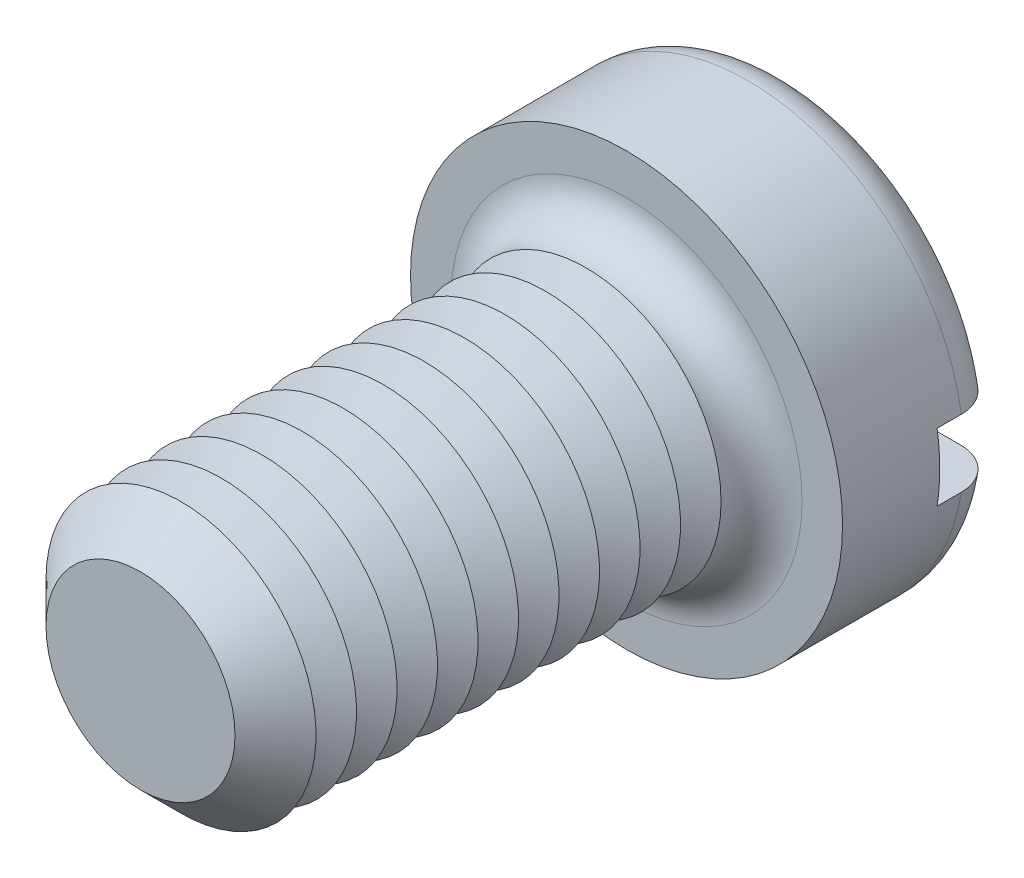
ISO-10303-21;
HEADER;
FILE_DESCRIPTION(('STEP AP214'),'2;1');
FILE_NAME('part.step','',(''),(''),'','','');
FILE_SCHEMA(('AUTOMOTIVE_DESIGN { 1 0 10303 214 1 1 1 1 }'));
ENDSEC;
DATA;
#1=APPLICATION_CONTEXT('core data for automotive mechanical design processes');
#2=APPLICATION_PROTOCOL_DEFINITION('international standard','automotive_design',2000,#1);
#3=PRODUCT_CONTEXT('',#1,'mechanical');
#4=PRODUCT('Part','Part','',(#3));
#5=PRODUCT_RELATED_PRODUCT_CATEGORY('part','',(#4));
#6=PRODUCT_DEFINITION_FORMATION('','',#4);
#7=PRODUCT_DEFINITION_CONTEXT('part definition',#1,'design');
#8=PRODUCT_DEFINITION('design','',#6,#7);
#9=PRODUCT_DEFINITION_SHAPE('','',#8);
#10=(LENGTH_UNIT() NAMED_UNIT(*) SI_UNIT(.MILLI.,.METRE.));
#11=(NAMED_UNIT(*) PLANE_ANGLE_UNIT() SI_UNIT($,.RADIAN.));
#12=(NAMED_UNIT(*) SI_UNIT($,.STERADIAN.) SOLID_ANGLE_UNIT());
#13=UNCERTAINTY_MEASURE_WITH_UNIT(LENGTH_MEASURE(1.E-05),#10,'distance_accuracy_value','');
#14=(GEOMETRIC_REPRESENTATION_CONTEXT(3) GLOBAL_UNCERTAINTY_ASSIGNED_CONTEXT((#13)) GLOBAL_UNIT_ASSIGNED_CONTEXT((#10,
#11,#12)) REPRESENTATION_CONTEXT('',''));
#15=CARTESIAN_POINT('',(0.,0.,0.));
#16=DIRECTION('',(0.,0.,1.));
#17=DIRECTION('',(1.,0.,0.));
#18=AXIS2_PLACEMENT_3D('',#15,#16,#17);
#19=CARTESIAN_POINT('',(0.,0.,-6.));
#20=DIRECTION('',(0.,0.,1.));
#21=DIRECTION('',(1.,0.,0.));
#22=AXIS2_PLACEMENT_3D('',#19,#20,#21);
#23=PLANE('',#22);
#24=CARTESIAN_POINT('',(0.,0.,-6.));
#25=DIRECTION('',(0.,0.,1.));
#26=DIRECTION('',(1.,0.,0.));
#27=AXIS2_PLACEMENT_3D('',#24,#25,#26);
#28=CIRCLE('',#27,6.5);
#29=CARTESIAN_POINT('',(-6.37867541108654,1.25,-6.));
#30=VERTEX_POINT('',#29);
#31=CARTESIAN_POINT('',(6.37867541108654,1.25,-6.));
#32=VERTEX_POINT('',#31);
#33=EDGE_CURVE('E116',#30,#32,#28,.F.);
#34=ORIENTED_EDGE('',*,*,#33,.T.);
#35=DIRECTION('',(1.,0.,0.));
#36=VECTOR('',#35,1.);
#37=CARTESIAN_POINT('',(-8.,1.25,-6.));
#38=LINE('',#37,#36);
#39=EDGE_CURVE('E111',#30,#32,#38,.T.);
#40=ORIENTED_EDGE('',*,*,#39,.F.);
#41=EDGE_LOOP('',(#34,#40));
#42=FACE_BOUND('',#41,.T.);
#43=ADVANCED_FACE('F39',(#42),#23,.F.);
#44=CARTESIAN_POINT('',(0.,0.,-4.5));
#45=DIRECTION('',(0.,0.,1.));
#46=DIRECTION('',(1.,0.,0.));
#47=AXIS2_PLACEMENT_3D('',#44,#45,#46);
#48=TOROIDAL_SURFACE('',#47,6.5,1.5);
#49=CARTESIAN_POINT('',(-7.63778128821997,1.25,-5.34492908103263));
#50=CARTESIAN_POINT('',(-7.58949199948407,1.25,-5.41482553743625));
#51=CARTESIAN_POINT('',(-7.53520056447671,1.25,-5.48065698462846));
#52=CARTESIAN_POINT('',(-7.41624971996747,1.25,-5.60228223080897));
#53=CARTESIAN_POINT('',(-7.35157642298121,1.25,-5.65806236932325));
#54=CARTESIAN_POINT('',(-7.21387612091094,1.25,-5.75795436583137));
#55=CARTESIAN_POINT('',(-7.14085828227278,1.25,-5.80207885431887));
#56=CARTESIAN_POINT('',(-6.98853766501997,1.25,-5.87758013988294));
#57=CARTESIAN_POINT('',(-6.90923642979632,1.25,-5.90896005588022));
#58=CARTESIAN_POINT('',(-6.74565677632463,1.25,-5.95849861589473));
#59=CARTESIAN_POINT('',(-6.66133328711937,1.25,-5.97650838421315));
#60=CARTESIAN_POINT('',(-6.49086565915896,1.25,-5.99833509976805));
#61=CARTESIAN_POINT('',(-6.40472129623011,1.25,-6.00215028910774));
#62=CARTESIAN_POINT('',(-6.23174891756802,1.25,-5.99550457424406));
#63=CARTESIAN_POINT('',(-6.14492874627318,1.25,-5.98483870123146));
#64=CARTESIAN_POINT('',(-5.97427268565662,1.25,-5.94920077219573));
#65=CARTESIAN_POINT('',(-5.89043699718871,1.25,-5.92422775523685));
#66=CARTESIAN_POINT('',(-5.72747580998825,1.25,-5.86041051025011));
#67=CARTESIAN_POINT('',(-5.64839123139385,1.25,-5.8214616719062));
#68=CARTESIAN_POINT('',(-5.49793182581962,1.25,-5.73076137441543));
#69=CARTESIAN_POINT('',(-5.42655700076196,1.25,-5.6790099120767));
#70=CARTESIAN_POINT('',(-5.29410028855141,1.25,-5.56444713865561));
#71=CARTESIAN_POINT('',(-5.23295591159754,1.25,-5.50170815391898));
#72=CARTESIAN_POINT('',(-5.12236155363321,1.25,-5.36664720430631));
#73=CARTESIAN_POINT('',(-5.07291010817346,1.25,-5.29432644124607));
#74=CARTESIAN_POINT('',(-4.98836421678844,1.25,-5.14389152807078));
#75=CARTESIAN_POINT('',(-4.95296843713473,1.25,-5.0659468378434));
#76=CARTESIAN_POINT('',(-4.89620356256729,1.25,-4.90510804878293));
#77=CARTESIAN_POINT('',(-4.87483169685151,1.25,-4.82221493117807));
#78=CARTESIAN_POINT('',(-4.8472995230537,1.25,-4.65636387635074));
#79=CARTESIAN_POINT('',(-4.84072446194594,1.25,-4.57347463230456));
#80=CARTESIAN_POINT('',(-4.84179430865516,1.25,-4.40779255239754));
#81=CARTESIAN_POINT('',(-4.84943782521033,1.25,-4.32499970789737));
#82=CARTESIAN_POINT('',(-4.87846819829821,1.25,-4.16301415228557));
#83=CARTESIAN_POINT('',(-4.89966978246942,1.25,-4.08378809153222));
#84=CARTESIAN_POINT('',(-4.95491528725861,1.25,-3.92995334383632));
#85=CARTESIAN_POINT('',(-4.98895983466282,1.25,-3.85534488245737));
#86=CARTESIAN_POINT('',(-5.06928242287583,1.25,-3.71183790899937));
#87=CARTESIAN_POINT('',(-5.11570495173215,1.25,-3.64302036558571));
#88=CARTESIAN_POINT('',(-5.21915370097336,1.25,-3.51388372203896));
#89=CARTESIAN_POINT('',(-5.27618132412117,1.25,-3.45356574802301));
#90=CARTESIAN_POINT('',(-5.40090076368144,1.25,-3.34137671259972));
#91=CARTESIAN_POINT('',(-5.46884305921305,1.25,-3.28978408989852));
#92=CARTESIAN_POINT('',(-5.61225757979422,1.25,-3.19841811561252));
#93=CARTESIAN_POINT('',(-5.68773079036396,1.25,-3.15864631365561));
#94=CARTESIAN_POINT('',(-5.84602026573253,1.25,-3.09111626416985));
#95=CARTESIAN_POINT('',(-5.92896901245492,1.25,-3.06366820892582));
#96=CARTESIAN_POINT('',(-6.09827849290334,1.25,-3.02294686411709));
#97=CARTESIAN_POINT('',(-6.18463944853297,1.25,-3.00967449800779));
#98=CARTESIAN_POINT('',(-6.35914138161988,1.25,-2.99765063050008));
#99=CARTESIAN_POINT('',(-6.4472913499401,1.25,-2.99902877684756));
#100=CARTESIAN_POINT('',(-6.62209547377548,1.25,-3.01665363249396));
#101=CARTESIAN_POINT('',(-6.70874965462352,1.25,-3.03290008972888));
#102=CARTESIAN_POINT('',(-6.87754008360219,1.25,-3.07975247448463));
#103=CARTESIAN_POINT('',(-6.95969991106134,1.25,-3.11027336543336));
#104=CARTESIAN_POINT('',(-7.11762200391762,1.25,-3.18486653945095));
#105=CARTESIAN_POINT('',(-7.19338469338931,1.25,-3.22893792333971));
#106=CARTESIAN_POINT('',(-7.33522754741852,1.25,-3.32873457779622));
#107=CARTESIAN_POINT('',(-7.40142768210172,1.25,-3.38428930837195));
#108=CARTESIAN_POINT('',(-7.52338344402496,1.25,-3.50587739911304));
#109=CARTESIAN_POINT('',(-7.5791399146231,1.25,-3.57190991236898));
#110=CARTESIAN_POINT('',(-7.67774856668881,1.25,-3.71151097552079));
#111=CARTESIAN_POINT('',(-7.72078137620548,1.25,-3.7849519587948));
#112=CARTESIAN_POINT('',(-7.79373860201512,1.25,-3.93807617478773));
#113=CARTESIAN_POINT('',(-7.82366445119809,1.25,-4.01775872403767));
#114=CARTESIAN_POINT('',(-7.86922494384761,1.25,-4.1801114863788));
#115=CARTESIAN_POINT('',(-7.88502105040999,1.25,-4.26273642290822));
#116=CARTESIAN_POINT('',(-7.90243332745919,1.25,-4.42948977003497));
#117=CARTESIAN_POINT('',(-7.90404643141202,1.25,-4.51361850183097));
#118=CARTESIAN_POINT('',(-7.89306914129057,1.25,-4.68049925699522));
#119=CARTESIAN_POINT('',(-7.88055163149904,1.25,-4.76325613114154));
#120=CARTESIAN_POINT('',(-7.84181179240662,1.25,-4.92542124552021));
#121=CARTESIAN_POINT('',(-7.81560657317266,1.25,-5.00483353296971));
#122=CARTESIAN_POINT('',(-7.76329893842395,1.25,-5.12766777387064));
#123=CARTESIAN_POINT('',(-7.74127773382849,1.25,-5.17287245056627));
#124=CARTESIAN_POINT('',(-7.69279783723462,1.25,-5.26083500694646));
#125=CARTESIAN_POINT('',(-7.66633917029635,1.25,-5.30359290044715));
#126=CARTESIAN_POINT('',(-7.63778128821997,1.25,-5.34492908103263));
#127=B_SPLINE_CURVE_WITH_KNOTS('',3,(#49,#50,#51,#52,#53,#54,#55,#56,#57,#58,#59,#60,#61,#62,
#63,#64,#65,#66,#67,#68,#69,#70,#71,#72,#73,#74,#75,#76,#77,#78,#79,#80,#81,#82,#83,#84,#85,#86,
#87,#88,#89,#90,#91,#92,#93,#94,#95,#96,#97,#98,#99,#100,#101,#102,#103,#104,#105,#106,#107,
#108,#109,#110,#111,#112,#113,#114,#115,#116,#117,#118,#119,#120,#121,#122,#123,#124,#125,#126),
.UNSPECIFIED.,.T.,.F.,(4,2,2,2,2,2,2,2,2,2,2,2,2,2,2,2,2,2,2,2,2,2,2,2,2,2,2,2,2,2,2,2,2,2,2,2,
2,2,4),(0.,0.254678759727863,0.509701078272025,0.764445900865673,1.01912834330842,
1.27660578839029,1.53411511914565,1.7953075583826,2.05651754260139,2.31972495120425,
2.58293242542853,2.84446831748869,3.10597143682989,3.36151874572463,3.61701554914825,
3.86525656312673,4.11347328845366,4.35836855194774,4.60327576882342,4.8511774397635,
5.0991119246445,5.35387584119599,5.60867314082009,5.86956650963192,6.13047687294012,
6.39369803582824,6.65691473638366,6.91858297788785,7.18023385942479,7.43824706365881,
7.69623942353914,7.95037087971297,8.20447454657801,8.45563599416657,8.70685174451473,
8.95677764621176,9.20639187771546,9.35700761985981,9.50762251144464),.UNSPECIFIED.);
#128=CARTESIAN_POINT('',(-7.90174031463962,1.25,-4.50000000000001));
#129=VERTEX_POINT('',#128);
#130=EDGE_CURVE('E259',#129,#30,#127,.T.);
#131=ORIENTED_EDGE('',*,*,#130,.F.);
#132=CARTESIAN_POINT('',(0.,0.,-4.5));
#133=DIRECTION('',(0.,0.,1.));
#134=DIRECTION('',(1.,0.,0.));
#135=AXIS2_PLACEMENT_3D('',#132,#133,#134);
#136=CIRCLE('',#135,8.);
#137=CARTESIAN_POINT('',(7.90174031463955,1.25,-4.5));
#138=VERTEX_POINT('',#137);
#139=EDGE_CURVE('E125',#138,#129,#136,.T.);
#140=ORIENTED_EDGE('',*,*,#139,.F.);
#141=CARTESIAN_POINT('',(4.95236709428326,1.25,-5.05808354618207));
#142=CARTESIAN_POINT('',(4.98477386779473,1.25,-5.13646278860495));
#143=CARTESIAN_POINT('',(5.02397623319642,1.25,-5.21210974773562));
#144=CARTESIAN_POINT('',(5.11464829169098,1.25,-5.35575180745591));
#145=CARTESIAN_POINT('',(5.16613670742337,1.25,-5.42373499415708));
#146=CARTESIAN_POINT('',(5.27963080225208,1.25,-5.55005899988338));
#147=CARTESIAN_POINT('',(5.34161871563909,1.25,-5.60841578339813));
#148=CARTESIAN_POINT('',(5.47431803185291,1.25,-5.71412381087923));
#149=CARTESIAN_POINT('',(5.545027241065,1.25,-5.76147781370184));
#150=CARTESIAN_POINT('',(5.69469818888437,1.25,-5.84486022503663));
#151=CARTESIAN_POINT('',(5.77379661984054,1.25,-5.88064336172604));
#152=CARTESIAN_POINT('',(5.93682776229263,1.25,-5.93863952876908));
#153=CARTESIAN_POINT('',(6.02076112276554,1.25,-5.96085073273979));
#154=CARTESIAN_POINT('',(6.19235911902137,1.25,-5.99130732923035));
#155=CARTESIAN_POINT('',(6.2800597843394,1.25,-5.99935025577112));
#156=CARTESIAN_POINT('',(6.45556807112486,1.25,-6.00057400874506));
#157=CARTESIAN_POINT('',(6.54337569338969,1.25,-5.99375472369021));
#158=CARTESIAN_POINT('',(6.71642471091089,1.25,-5.96539034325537));
#159=CARTESIAN_POINT('',(6.8016703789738,1.25,-5.94387137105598));
#160=CARTESIAN_POINT('',(6.96726399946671,1.25,-5.8866508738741));
#161=CARTESIAN_POINT('',(7.04761223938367,1.25,-5.85095018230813));
#162=CARTESIAN_POINT('',(7.2000703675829,1.25,-5.7668235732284));
#163=CARTESIAN_POINT('',(7.27226868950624,1.25,-5.71855796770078));
#164=CARTESIAN_POINT('',(7.40737382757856,1.25,-5.61041520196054));
#165=CARTESIAN_POINT('',(7.47028138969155,1.25,-5.55053897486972));
#166=CARTESIAN_POINT('',(7.5840004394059,1.25,-5.42185995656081));
#167=CARTESIAN_POINT('',(7.63498189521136,1.25,-5.35320736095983));
#168=CARTESIAN_POINT('',(7.72451646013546,1.25,-5.20822613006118));
#169=CARTESIAN_POINT('',(7.76307051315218,1.25,-5.13189807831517));
#170=CARTESIAN_POINT('',(7.82615156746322,1.25,-4.97479919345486));
#171=CARTESIAN_POINT('',(7.85085353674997,1.25,-4.89409858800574));
#172=CARTESIAN_POINT('',(7.88624162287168,1.25,-4.72968126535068));
#173=CARTESIAN_POINT('',(7.89692844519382,1.25,-4.64596470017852));
#174=CARTESIAN_POINT('',(7.90393395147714,1.25,-4.47857496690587));
#175=CARTESIAN_POINT('',(7.900361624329,1.25,-4.39490633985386));
#176=CARTESIAN_POINT('',(7.8792027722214,1.25,-4.22936201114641));
#177=CARTESIAN_POINT('',(7.86161649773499,1.25,-4.14748627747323));
#178=CARTESIAN_POINT('',(7.81298565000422,1.25,-3.98793539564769));
#179=CARTESIAN_POINT('',(7.78195585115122,1.25,-3.91025574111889));
#180=CARTESIAN_POINT('',(7.70736418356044,1.25,-3.76116938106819));
#181=CARTESIAN_POINT('',(7.66380211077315,1.25,-3.68976277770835));
#182=CARTESIAN_POINT('',(7.56515173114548,1.25,-3.55480889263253));
#183=CARTESIAN_POINT('',(7.51000119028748,1.25,-3.49130712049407));
#184=CARTESIAN_POINT('',(7.38992820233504,1.25,-3.3743390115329));
#185=CARTESIAN_POINT('',(7.32500529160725,1.25,-3.32087315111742));
#186=CARTESIAN_POINT('',(7.18646521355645,1.25,-3.22483712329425));
#187=CARTESIAN_POINT('',(7.11275872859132,1.25,-3.18239583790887));
#188=CARTESIAN_POINT('',(6.95934489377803,1.25,-3.11028530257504));
#189=CARTESIAN_POINT('',(6.87963710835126,1.25,-3.08061698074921));
#190=CARTESIAN_POINT('',(6.71523243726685,1.25,-3.03442872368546));
#191=CARTESIAN_POINT('',(6.63047940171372,1.25,-3.0181086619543));
#192=CARTESIAN_POINT('',(6.45944163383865,1.25,-2.99971307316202));
#193=CARTESIAN_POINT('',(6.37315677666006,1.25,-2.99763871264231));
#194=CARTESIAN_POINT('',(6.20021063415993,1.25,-3.00779604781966));
#195=CARTESIAN_POINT('',(6.11356117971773,1.25,-3.02022976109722));
#196=CARTESIAN_POINT('',(5.94354092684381,1.25,-3.05935975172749));
#197=CARTESIAN_POINT('',(5.86017035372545,1.25,-3.08605700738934));
#198=CARTESIAN_POINT('',(5.69848536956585,1.25,-3.15322746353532));
#199=CARTESIAN_POINT('',(5.62021039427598,1.25,-3.1937956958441));
#200=CARTESIAN_POINT('',(5.47164170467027,1.25,-3.28758816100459));
#201=CARTESIAN_POINT('',(5.40134797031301,1.25,-3.3408123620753));
#202=CARTESIAN_POINT('',(5.27136483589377,1.25,-3.45806317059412));
#203=CARTESIAN_POINT('',(5.21160120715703,1.25,-3.52200740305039));
#204=CARTESIAN_POINT('',(5.10396941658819,1.25,-3.65922833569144));
#205=CARTESIAN_POINT('',(5.05609917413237,1.25,-3.73250340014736));
#206=CARTESIAN_POINT('',(4.97487058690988,1.25,-3.8844714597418));
#207=CARTESIAN_POINT('',(4.94119529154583,1.25,-3.96299495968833));
#208=CARTESIAN_POINT('',(4.88793322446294,1.25,-4.12470694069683));
#209=CARTESIAN_POINT('',(4.86834741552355,1.25,-4.20789574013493));
#210=CARTESIAN_POINT('',(4.84433446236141,1.25,-4.3740749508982));
#211=CARTESIAN_POINT('',(4.83950391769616,1.25,-4.45700748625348));
#212=CARTESIAN_POINT('',(4.84404021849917,1.25,-4.62240731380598));
#213=CARTESIAN_POINT('',(4.85338770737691,1.25,-4.70487508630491));
#214=CARTESIAN_POINT('',(4.87895619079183,1.25,-4.83246978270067));
#215=CARTESIAN_POINT('',(4.89056704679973,1.25,-4.87856970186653));
#216=CARTESIAN_POINT('',(4.91819711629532,1.25,-4.96942661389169));
#217=CARTESIAN_POINT('',(4.93421619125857,1.25,-5.01418364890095));
#218=CARTESIAN_POINT('',(4.95236709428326,1.25,-5.05808354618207));
#219=B_SPLINE_CURVE_WITH_KNOTS('',3,(#141,#142,#143,#144,#145,#146,#147,#148,#149,#150,#151,
#152,#153,#154,#155,#156,#157,#158,#159,#160,#161,#162,#163,#164,#165,#166,#167,#168,#169,#170,
#171,#172,#173,#174,#175,#176,#177,#178,#179,#180,#181,#182,#183,#184,#185,#186,#187,#188,#189,
#190,#191,#192,#193,#194,#195,#196,#197,#198,#199,#200,#201,#202,#203,#204,#205,#206,#207,#208,
#209,#210,#211,#212,#213,#214,#215,#216,#217,#218),.UNSPECIFIED.,.T.,.F.,(4,2,2,2,2,2,2,2,2,2,2,
2,2,2,2,2,2,2,2,2,2,2,2,2,2,2,2,2,2,2,2,2,2,2,2,2,2,2,4),(0.,0.25426396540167,0.508917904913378,
0.763145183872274,1.01730864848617,1.27655188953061,1.53583000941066,1.79878406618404,
2.06174009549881,2.32423003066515,2.5867045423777,2.84598168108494,3.10523799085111,
3.36053725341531,3.61581712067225,3.8677953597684,4.11976091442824,4.36980428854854,
4.61984319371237,4.86960800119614,5.11937687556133,5.37052303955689,5.62168112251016,
5.87565515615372,6.12964764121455,6.38737709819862,6.64512765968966,6.90651052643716,
7.16791132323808,7.43114013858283,7.69436829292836,7.95565940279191,8.21690477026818,
8.47196060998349,8.72703387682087,8.97506819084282,9.22276418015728,9.36518087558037,
9.50759309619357),.UNSPECIFIED.);
#220=EDGE_CURVE('E261',#32,#138,#219,.T.);
#221=ORIENTED_EDGE('',*,*,#220,.F.);
#222=ORIENTED_EDGE('',*,*,#33,.F.);
#223=EDGE_LOOP('',(#131,#140,#221,#222));
#224=FACE_BOUND('',#223,.T.);
#225=ADVANCED_FACE('F243',(#224),#48,.T.);
#226=CARTESIAN_POINT('',(0.,0.,-6.));
#227=DIRECTION('',(0.,0.,1.));
#228=DIRECTION('',(1.,0.,0.));
#229=AXIS2_PLACEMENT_3D('',#226,#227,#228);
#230=CYLINDRICAL_SURFACE('',#229,8.);
#231=DIRECTION('',(0.,0.,1.));
#232=VECTOR('',#231,1.);
#233=CARTESIAN_POINT('',(7.90174031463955,1.25,-6.));
#234=LINE('',#233,#232);
#235=CARTESIAN_POINT('',(7.90174031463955,1.25,-3.6));
#236=VERTEX_POINT('',#235);
#237=EDGE_CURVE('E277',#138,#236,#234,.T.);
#238=ORIENTED_EDGE('',*,*,#237,.F.);
#239=ORIENTED_EDGE('',*,*,#139,.T.);
#240=DIRECTION('',(0.,0.,1.));
#241=VECTOR('',#240,1.);
#242=CARTESIAN_POINT('',(-7.90174031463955,1.25,-6.));
#243=LINE('',#242,#241);
#244=CARTESIAN_POINT('',(-7.90174031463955,1.25,-3.6));
#245=VERTEX_POINT('',#244);
#246=EDGE_CURVE('E63',#245,#129,#243,.F.);
#247=ORIENTED_EDGE('',*,*,#246,.F.);
#248=CARTESIAN_POINT('',(0.,0.,-3.6));
#249=DIRECTION('',(0.,0.,-1.));
#250=DIRECTION('',(-1.,0.,0.));
#251=AXIS2_PLACEMENT_3D('',#248,#249,#250);
#252=CIRCLE('',#251,8.);
#253=CARTESIAN_POINT('',(-7.90174031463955,-1.25,-3.6));
#254=VERTEX_POINT('',#253);
#255=EDGE_CURVE('E43',#245,#254,#252,.F.);
#256=ORIENTED_EDGE('',*,*,#255,.T.);
#257=DIRECTION('',(0.,0.,1.));
#258=VECTOR('',#257,1.);
#259=CARTESIAN_POINT('',(-7.90174031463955,-1.25,-6.));
#260=LINE('',#259,#258);
#261=CARTESIAN_POINT('',(-7.9017403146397,-1.25,-4.49999999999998));
#262=VERTEX_POINT('',#261);
#263=EDGE_CURVE('E274',#262,#254,#260,.T.);
#264=ORIENTED_EDGE('',*,*,#263,.F.);
#265=CARTESIAN_POINT('',(7.90174031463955,-1.25,-4.5));
#266=VERTEX_POINT('',#265);
#267=EDGE_CURVE('E127',#262,#266,#136,.T.);
#268=ORIENTED_EDGE('',*,*,#267,.T.);
#269=DIRECTION('',(0.,0.,1.));
#270=VECTOR('',#269,1.);
#271=CARTESIAN_POINT('',(7.90174031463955,-1.25,-6.));
#272=LINE('',#271,#270);
#273=CARTESIAN_POINT('',(7.90174031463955,-1.25,-3.6));
#274=VERTEX_POINT('',#273);
#275=EDGE_CURVE('E55',#274,#266,#272,.F.);
#276=ORIENTED_EDGE('',*,*,#275,.F.);
#277=EDGE_CURVE('E11',#274,#236,#252,.F.);
#278=ORIENTED_EDGE('',*,*,#277,.T.);
#279=EDGE_LOOP('',(#238,#239,#247,#256,#264,#268,#276,#278));
#280=FACE_BOUND('',#279,.T.);
#281=CARTESIAN_POINT('',(0.,0.,0.));
#282=DIRECTION('',(0.,0.,1.));
#283=DIRECTION('',(1.,0.,0.));
#284=AXIS2_PLACEMENT_3D('',#281,#282,#283);
#285=CIRCLE('',#284,8.);
#286=CARTESIAN_POINT('',(8.,0.,0.));
#287=VERTEX_POINT('',#286);
#288=EDGE_CURVE('E280',#287,#287,#285,.T.);
#289=ORIENTED_EDGE('',*,*,#288,.F.);
#290=EDGE_LOOP('',(#289));
#291=FACE_BOUND('',#290,.T.);
#292=ADVANCED_FACE('F239',(#280,#291),#230,.T.);
#293=CARTESIAN_POINT('',(6.37867541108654,-1.25,-6.));
#294=VERTEX_POINT('',#293);
#295=CARTESIAN_POINT('',(-6.37867541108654,-1.25,-6.));
#296=VERTEX_POINT('',#295);
#297=EDGE_CURVE('E109',#294,#296,#28,.F.);
#298=ORIENTED_EDGE('',*,*,#297,.T.);
#299=DIRECTION('',(-1.,0.,0.));
#300=VECTOR('',#299,1.);
#301=CARTESIAN_POINT('',(-8.,-1.25,-6.));
#302=LINE('',#301,#300);
#303=EDGE_CURVE('E96',#294,#296,#302,.T.);
#304=ORIENTED_EDGE('',*,*,#303,.F.);
#305=EDGE_LOOP('',(#298,#304));
#306=FACE_BOUND('',#305,.T.);
#307=ADVANCED_FACE('F108',(#306),#23,.F.);
#308=CARTESIAN_POINT('',(0.,0.,0.));
#309=DIRECTION('',(0.,0.,1.));
#310=DIRECTION('',(1.,0.,0.));
#311=AXIS2_PLACEMENT_3D('',#308,#309,#310);
#312=PLANE('',#311);
#313=CARTESIAN_POINT('',(0.,0.,0.));
#314=DIRECTION('',(0.,0.,1.));
#315=DIRECTION('',(1.,0.,0.));
#316=AXIS2_PLACEMENT_3D('',#313,#314,#315);
#317=CIRCLE('',#316,6.5);
#318=CARTESIAN_POINT('',(6.5,0.,0.));
#319=VERTEX_POINT('',#318);
#320=EDGE_CURVE('E115',#319,#319,#317,.F.);
#321=ORIENTED_EDGE('',*,*,#320,.T.);
#322=EDGE_LOOP('',(#321));
#323=FACE_BOUND('',#322,.T.);
#324=ORIENTED_EDGE('',*,*,#288,.T.);
#325=EDGE_LOOP('',(#324));
#326=FACE_BOUND('',#325,.T.);
#327=ADVANCED_FACE('F238',(#323,#326),#312,.T.);
#328=CARTESIAN_POINT('',(-7.63778128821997,-1.25,-5.34492908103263));
#329=CARTESIAN_POINT('',(-7.68527581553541,-1.25,-5.27616964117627));
#330=CARTESIAN_POINT('',(-7.72703224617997,-1.25,-5.20337764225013));
#331=CARTESIAN_POINT('',(-7.79778035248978,-1.25,-5.05176511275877));
#332=CARTESIAN_POINT('',(-7.82675823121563,-1.25,-4.97293817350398));
#333=CARTESIAN_POINT('',(-7.87103239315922,-1.25,-4.81153865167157));
#334=CARTESIAN_POINT('',(-7.8863313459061,-1.25,-4.72896680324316));
#335=CARTESIAN_POINT('',(-7.90278562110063,-1.25,-4.56244566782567));
#336=CARTESIAN_POINT('',(-7.90394420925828,-1.25,-4.4784967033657));
#337=CARTESIAN_POINT('',(-7.89211470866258,-1.25,-4.31190980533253));
#338=CARTESIAN_POINT('',(-7.87917806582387,-1.25,-4.22926821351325));
#339=CARTESIAN_POINT('',(-7.8396278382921,-1.25,-4.06732477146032));
#340=CARTESIAN_POINT('',(-7.81301388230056,-1.25,-3.98802301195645));
#341=CARTESIAN_POINT('',(-7.74686575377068,-1.25,-3.83490116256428));
#342=CARTESIAN_POINT('',(-7.70731700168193,-1.25,-3.76108737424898));
#343=CARTESIAN_POINT('',(-7.61647675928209,-1.25,-3.62108231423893));
#344=CARTESIAN_POINT('',(-7.56518496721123,-1.25,-3.55489123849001));
#345=CARTESIAN_POINT('',(-7.45192141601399,-1.25,-3.43145488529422));
#346=CARTESIAN_POINT('',(-7.3898717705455,-1.25,-3.37428109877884));
#347=CARTESIAN_POINT('',(-7.25715883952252,-1.25,-3.27100737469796));
#348=CARTESIAN_POINT('',(-7.18649507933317,-1.25,-3.22490804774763));
#349=CARTESIAN_POINT('',(-7.03760898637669,-1.25,-3.14445316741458));
#350=CARTESIAN_POINT('',(-6.95930204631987,-1.25,-3.1102542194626));
#351=CARTESIAN_POINT('',(-6.79811453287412,-1.25,-3.05526915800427));
#352=CARTESIAN_POINT('',(-6.71523359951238,-1.25,-3.03448410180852));
#353=CARTESIAN_POINT('',(-6.5459165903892,-1.25,-3.006592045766));
#354=CARTESIAN_POINT('',(-6.45944575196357,-1.25,-2.99969602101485));
#355=CARTESIAN_POINT('',(-6.28655568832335,-1.25,-3.00032465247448));
#356=CARTESIAN_POINT('',(-6.20013646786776,-1.25,-3.00785047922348));
#357=CARTESIAN_POINT('',(-6.02865505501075,-1.25,-3.03725742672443));
#358=CARTESIAN_POINT('',(-5.94362352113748,-1.25,-3.05931758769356));
#359=CARTESIAN_POINT('',(-5.77844448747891,-1.25,-3.11735373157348));
#360=CARTESIAN_POINT('',(-5.69829723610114,-1.25,-3.15333042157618));
#361=CARTESIAN_POINT('',(-5.54495924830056,-1.25,-3.23837037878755));
#362=CARTESIAN_POINT('',(-5.47178958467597,-1.25,-3.28747168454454));
#363=CARTESIAN_POINT('',(-5.33486536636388,-1.25,-3.39741183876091));
#364=CARTESIAN_POINT('',(-5.27111040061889,-1.25,-3.45825017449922));
#365=CARTESIAN_POINT('',(-5.15579778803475,-1.25,-3.58914722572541));
#366=CARTESIAN_POINT('',(-5.10409113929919,-1.25,-3.65907455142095));
#367=CARTESIAN_POINT('',(-5.01353659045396,-1.25,-3.8068142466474));
#368=CARTESIAN_POINT('',(-4.97468647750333,-1.25,-3.88462525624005));
#369=CARTESIAN_POINT('',(-4.91208858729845,-1.25,-4.04366636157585));
#370=CARTESIAN_POINT('',(-4.88795969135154,-1.25,-4.12474643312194));
#371=CARTESIAN_POINT('',(-4.85404909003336,-1.25,-4.28985038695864));
#372=CARTESIAN_POINT('',(-4.84426486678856,-1.25,-4.37387374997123));
#373=CARTESIAN_POINT('',(-4.83946276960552,-1.25,-4.54023897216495));
#374=CARTESIAN_POINT('',(-4.8440833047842,-1.25,-4.62257060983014));
#375=CARTESIAN_POINT('',(-4.86713763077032,-1.25,-4.78527148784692));
#376=CARTESIAN_POINT('',(-4.88557092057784,-1.25,-4.86564079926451));
#377=CARTESIAN_POINT('',(-4.9355229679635,-1.25,-5.02189555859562));
#378=CARTESIAN_POINT('',(-4.9669975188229,-1.25,-5.09779517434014));
#379=CARTESIAN_POINT('',(-5.04199393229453,-1.25,-5.24338322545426));
#380=CARTESIAN_POINT('',(-5.0855168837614,-1.25,-5.31307109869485));
#381=CARTESIAN_POINT('',(-5.18427540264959,-1.25,-5.44580979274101));
#382=CARTESIAN_POINT('',(-5.2397318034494,-1.25,-5.50869620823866));
#383=CARTESIAN_POINT('',(-5.36015301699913,-1.25,-5.62458635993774));
#384=CARTESIAN_POINT('',(-5.42511919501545,-1.25,-5.67758867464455));
#385=CARTESIAN_POINT('',(-5.56469412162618,-1.25,-5.7737610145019));
#386=CARTESIAN_POINT('',(-5.6395232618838,-1.25,-5.81661133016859));
#387=CARTESIAN_POINT('',(-5.79521544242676,-1.25,-5.8894110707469));
#388=CARTESIAN_POINT('',(-5.8760791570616,-1.25,-5.91935905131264));
#389=CARTESIAN_POINT('',(-6.04317815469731,-1.25,-5.9660059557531));
#390=CARTESIAN_POINT('',(-6.12948555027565,-1.25,-5.98244700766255));
#391=CARTESIAN_POINT('',(-6.30363462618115,-1.25,-6.00064866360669));
#392=CARTESIAN_POINT('',(-6.39147629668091,-1.25,-6.00240936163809));
#393=CARTESIAN_POINT('',(-6.5664192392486,-1.25,-5.9911248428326));
#394=CARTESIAN_POINT('',(-6.653518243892,-1.25,-5.9780442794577));
#395=CARTESIAN_POINT('',(-6.82426167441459,-1.25,-5.93729204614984));
#396=CARTESIAN_POINT('',(-6.90790538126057,-1.25,-5.90961735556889));
#397=CARTESIAN_POINT('',(-7.06846412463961,-1.25,-5.84071272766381));
#398=CARTESIAN_POINT('',(-7.14543542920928,-1.25,-5.79961377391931));
#399=CARTESIAN_POINT('',(-7.29116896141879,-1.25,-5.70491210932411));
#400=CARTESIAN_POINT('',(-7.35994165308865,-1.25,-5.65132560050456));
#401=CARTESIAN_POINT('',(-7.46362894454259,-1.25,-5.55509815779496));
#402=CARTESIAN_POINT('',(-7.50165191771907,-1.25,-5.51575032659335));
#403=CARTESIAN_POINT('',(-7.57319530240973,-1.25,-5.43315308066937));
#404=CARTESIAN_POINT('',(-7.60671575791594,-1.25,-5.38990370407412));
#405=CARTESIAN_POINT('',(-7.63778128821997,-1.25,-5.34492908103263));
#406=B_SPLINE_CURVE_WITH_KNOTS('',3,(#328,#329,#330,#331,#332,#333,#334,#335,#336,#337,#338,
#339,#340,#341,#342,#343,#344,#345,#346,#347,#348,#349,#350,#351,#352,#353,#354,#355,#356,#357,
#358,#359,#360,#361,#362,#363,#364,#365,#366,#367,#368,#369,#370,#371,#372,#373,#374,#375,#376,
#377,#378,#379,#380,#381,#382,#383,#384,#385,#386,#387,#388,#389,#390,#391,#392,#393,#394,#395,
#396,#397,#398,#399,#400,#401,#402,#403,#404,#405),.UNSPECIFIED.,.T.,.F.,(4,2,2,2,2,2,2,2,2,2,2,
2,2,2,2,2,2,2,2,2,2,2,2,2,2,2,2,2,2,2,2,2,2,2,2,2,2,2,4),(0.,0.250506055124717,
0.501281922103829,0.752008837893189,1.00267784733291,1.25243500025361,1.50219893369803,
1.75224536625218,2.00229822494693,2.25424343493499,2.50620253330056,2.76136198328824,
3.01654154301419,3.27556891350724,3.53461730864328,3.79691797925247,4.05923197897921,
4.32231463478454,4.5853858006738,4.84500678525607,5.10458306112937,5.3571172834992,
5.60960717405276,5.85581050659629,6.10200490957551,6.34737151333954,6.59276029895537,
6.84315522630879,7.09358613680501,7.35108485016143,7.60861238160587,7.87094926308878,
8.13328446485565,8.39624576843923,8.65926152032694,8.91978401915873,9.17997036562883,
9.34382460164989,9.50767723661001),.UNSPECIFIED.);
#407=EDGE_CURVE('E103',#296,#262,#406,.T.);
#408=ORIENTED_EDGE('',*,*,#407,.F.);
#409=ORIENTED_EDGE('',*,*,#297,.F.);
#410=CARTESIAN_POINT('',(4.95236709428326,-1.25,-5.05808354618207));
#411=CARTESIAN_POINT('',(4.92105512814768,-1.25,-4.98233216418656));
#412=CARTESIAN_POINT('',(4.89604361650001,-1.25,-4.90392040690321));
#413=CARTESIAN_POINT('',(4.85951223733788,-1.25,-4.74395758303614));
#414=CARTESIAN_POINT('',(4.8480045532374,-1.25,-4.66240375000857));
#415=CARTESIAN_POINT('',(4.83891469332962,-1.25,-4.49852199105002));
#416=CARTESIAN_POINT('',(4.84133145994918,-1.25,-4.41619412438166));
#417=CARTESIAN_POINT('',(4.8600038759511,-1.25,-4.25314313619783));
#418=CARTESIAN_POINT('',(4.87625705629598,-1.25,-4.17241973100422));
#419=CARTESIAN_POINT('',(4.92196554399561,-1.25,-4.01505032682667));
#420=CARTESIAN_POINT('',(4.95138456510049,-1.25,-3.93839376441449));
#421=CARTESIAN_POINT('',(5.02244158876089,-1.25,-3.79097367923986));
#422=CARTESIAN_POINT('',(5.06408092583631,-1.25,-3.72021080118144));
#423=CARTESIAN_POINT('',(5.15918188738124,-1.25,-3.5851203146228));
#424=CARTESIAN_POINT('',(5.21285223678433,-1.25,-3.5209397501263));
#425=CARTESIAN_POINT('',(5.32993512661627,-1.25,-3.40218700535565));
#426=CARTESIAN_POINT('',(5.39334903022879,-1.25,-3.34761617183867));
#427=CARTESIAN_POINT('',(5.5300552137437,-1.25,-3.24801679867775));
#428=CARTESIAN_POINT('',(5.60357647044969,-1.25,-3.20330242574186));
#429=CARTESIAN_POINT('',(5.75697062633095,-1.25,-3.1265687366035));
#430=CARTESIAN_POINT('',(5.83684424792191,-1.25,-3.09455086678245));
#431=CARTESIAN_POINT('',(6.00239031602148,-1.25,-3.04353393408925));
#432=CARTESIAN_POINT('',(6.08814636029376,-1.25,-3.02480570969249));
#433=CARTESIAN_POINT('',(6.26158564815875,-1.25,-3.00194915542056));
#434=CARTESIAN_POINT('',(6.34926896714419,-1.25,-2.997821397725));
#435=CARTESIAN_POINT('',(6.52441816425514,-1.25,-3.00435236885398));
#436=CARTESIAN_POINT('',(6.61188199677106,-1.25,-3.01506655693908));
#437=CARTESIAN_POINT('',(6.78373130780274,-1.25,-3.05116556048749));
#438=CARTESIAN_POINT('',(6.8681168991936,-1.25,-3.07654983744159));
#439=CARTESIAN_POINT('',(7.03056473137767,-1.25,-3.14105639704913));
#440=CARTESIAN_POINT('',(7.10867812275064,-1.25,-3.18004978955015));
#441=CARTESIAN_POINT('',(7.25711285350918,-1.25,-3.27078804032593));
#442=CARTESIAN_POINT('',(7.327434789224,-1.25,-3.32253192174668));
#443=CARTESIAN_POINT('',(7.45716954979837,-1.25,-3.4364775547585));
#444=CARTESIAN_POINT('',(7.51672925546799,-1.25,-3.49851206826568));
#445=CARTESIAN_POINT('',(7.62440498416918,-1.25,-3.63182557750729));
#446=CARTESIAN_POINT('',(7.67252193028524,-1.25,-3.70310382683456));
#447=CARTESIAN_POINT('',(7.75523498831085,-1.25,-3.8517825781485));
#448=CARTESIAN_POINT('',(7.79001407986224,-1.25,-3.92908131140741));
#449=CARTESIAN_POINT('',(7.84595474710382,-1.25,-4.08845836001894));
#450=CARTESIAN_POINT('',(7.86711715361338,-1.25,-4.1705363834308));
#451=CARTESIAN_POINT('',(7.89503817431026,-1.25,-4.3362768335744));
#452=CARTESIAN_POINT('',(7.90193595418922,-1.25,-4.41991584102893));
#453=CARTESIAN_POINT('',(7.90153623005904,-1.25,-4.58715860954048));
#454=CARTESIAN_POINT('',(7.89423915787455,-1.25,-4.67076237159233));
#455=CARTESIAN_POINT('',(7.86572271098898,-1.25,-4.83525080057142));
#456=CARTESIAN_POINT('',(7.84455307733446,-1.25,-4.91614410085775));
#457=CARTESIAN_POINT('',(7.78897430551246,-1.25,-5.0732444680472));
#458=CARTESIAN_POINT('',(7.75456511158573,-1.25,-5.1494515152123));
#459=CARTESIAN_POINT('',(7.67339923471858,-1.25,-5.29528903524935));
#460=CARTESIAN_POINT('',(7.62660424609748,-1.25,-5.36489817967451));
#461=CARTESIAN_POINT('',(7.52209201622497,-1.25,-5.49536318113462));
#462=CARTESIAN_POINT('',(7.4643743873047,-1.25,-5.55621872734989));
#463=CARTESIAN_POINT('',(7.33909994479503,-1.25,-5.66807257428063));
#464=CARTESIAN_POINT('',(7.27145672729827,-1.25,-5.71897407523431));
#465=CARTESIAN_POINT('',(7.12868060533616,-1.25,-5.80887807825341));
#466=CARTESIAN_POINT('',(7.0535472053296,-1.25,-5.84787979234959));
#467=CARTESIAN_POINT('',(6.89682225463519,-1.25,-5.91345911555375));
#468=CARTESIAN_POINT('',(6.81515596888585,-1.25,-5.93985808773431));
#469=CARTESIAN_POINT('',(6.64858434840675,-1.25,-5.97879449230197));
#470=CARTESIAN_POINT('',(6.56367874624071,-1.25,-5.99133077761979));
#471=CARTESIAN_POINT('',(6.39168259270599,-1.25,-6.00236627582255));
#472=CARTESIAN_POINT('',(6.30457835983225,-1.25,-6.00065255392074));
#473=CARTESIAN_POINT('',(6.13186422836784,-1.25,-5.98278857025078));
#474=CARTESIAN_POINT('',(6.04625438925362,-1.25,-5.96663773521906));
#475=CARTESIAN_POINT('',(5.87802521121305,-1.25,-5.92012173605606));
#476=CARTESIAN_POINT('',(5.79544617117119,-1.25,-5.88961066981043));
#477=CARTESIAN_POINT('',(5.63656223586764,-1.25,-5.81513349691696));
#478=CARTESIAN_POINT('',(5.56025908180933,-1.25,-5.77116367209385));
#479=CARTESIAN_POINT('',(5.4162607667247,-1.25,-5.67098882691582));
#480=CARTESIAN_POINT('',(5.34855795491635,-1.25,-5.61479480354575));
#481=CARTESIAN_POINT('',(5.22382615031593,-1.25,-5.49168804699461));
#482=CARTESIAN_POINT('',(5.16678340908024,-1.25,-5.42478932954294));
#483=CARTESIAN_POINT('',(5.08326589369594,-1.25,-5.3075481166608));
#484=CARTESIAN_POINT('',(5.05313168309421,-1.25,-5.25976959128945));
#485=CARTESIAN_POINT('',(4.99845900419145,-1.25,-5.16110869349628));
#486=CARTESIAN_POINT('',(4.9739204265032,-1.25,-5.11022638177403));
#487=CARTESIAN_POINT('',(4.95236709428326,-1.25,-5.05808354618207));
#488=B_SPLINE_CURVE_WITH_KNOTS('',3,(#410,#411,#412,#413,#414,#415,#416,#417,#418,#419,#420,
#421,#422,#423,#424,#425,#426,#427,#428,#429,#430,#431,#432,#433,#434,#435,#436,#437,#438,#439,
#440,#441,#442,#443,#444,#445,#446,#447,#448,#449,#450,#451,#452,#453,#454,#455,#456,#457,#458,
#459,#460,#461,#462,#463,#464,#465,#466,#467,#468,#469,#470,#471,#472,#473,#474,#475,#476,#477,
#478,#479,#480,#481,#482,#483,#484,#485,#486,#487),.UNSPECIFIED.,.T.,.F.,(4,2,2,2,2,2,2,2,2,2,2,
2,2,2,2,2,2,2,2,2,2,2,2,2,2,2,2,2,2,2,2,2,2,2,2,2,2,2,4),(0.,0.245701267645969,
0.491624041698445,0.737528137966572,0.983388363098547,1.22857510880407,1.47378864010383,
1.72364048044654,1.97352730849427,2.2304941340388,2.48749022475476,2.74958408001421,
3.01168820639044,3.2747743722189,3.53785088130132,3.79850056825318,4.05913029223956,
4.31587819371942,4.57260537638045,4.82567253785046,5.07872425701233,5.32929532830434,
5.57985877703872,5.82952869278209,6.07919966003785,6.32965199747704,6.58011322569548,
6.8329006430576,7.08570479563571,7.3419930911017,7.59830259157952,7.85844887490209,
8.11860548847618,8.38146435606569,8.64439590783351,8.90709189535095,9.16944670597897,
9.33857644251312,9.5077028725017),.UNSPECIFIED.);
#489=EDGE_CURVE('E92',#266,#294,#488,.T.);
#490=ORIENTED_EDGE('',*,*,#489,.F.);
#491=ORIENTED_EDGE('',*,*,#267,.F.);
#492=EDGE_LOOP('',(#408,#409,#490,#491));
#493=FACE_BOUND('',#492,.T.);
#494=ADVANCED_FACE('F113',(#493),#48,.T.);
#495=CARTESIAN_POINT('',(0.,0.,1.5));
#496=DIRECTION('',(0.,0.,1.));
#497=DIRECTION('',(1.,0.,0.));
#498=AXIS2_PLACEMENT_3D('',#495,#496,#497);
#499=TOROIDAL_SURFACE('',#498,6.5,1.5);
#500=ORIENTED_EDGE('',*,*,#320,.F.);
#501=EDGE_LOOP('',(#500));
#502=FACE_BOUND('',#501,.T.);
#503=CARTESIAN_POINT('',(0.,0.,1.5));
#504=DIRECTION('',(0.,0.,-1.));
#505=DIRECTION('',(-1.,0.,0.));
#506=AXIS2_PLACEMENT_3D('',#503,#504,#505);
#507=CIRCLE('',#506,5.);
#508=CARTESIAN_POINT('',(-5.,0.,1.5));
#509=VERTEX_POINT('',#508);
#510=EDGE_CURVE('E285',#509,#509,#507,.T.);
#511=ORIENTED_EDGE('',*,*,#510,.T.);
#512=EDGE_LOOP('',(#511));
#513=FACE_BOUND('',#512,.T.);
#514=ADVANCED_FACE('F231',(#502,#513),#499,.F.);
#515=CARTESIAN_POINT('',(0.,0.,2.25));
#516=DIRECTION('',(0.,0.,-1.));
#517=DIRECTION('',(-1.,0.,0.));
#518=AXIS2_PLACEMENT_3D('',#515,#516,#517);
#519=CONICAL_SURFACE('',#518,3.70096189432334,1.0471975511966);
#520=ORIENTED_EDGE('',*,*,#510,.F.);
#521=EDGE_LOOP('',(#520));
#522=FACE_BOUND('',#521,.T.);
#523=CARTESIAN_POINT('',(0.,0.,2.25));
#524=DIRECTION('',(0.,0.,-1.));
#525=DIRECTION('',(-1.,0.,0.));
#526=AXIS2_PLACEMENT_3D('',#523,#524,#525);
#527=CIRCLE('',#526,3.70096189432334);
#528=CARTESIAN_POINT('',(-3.70096189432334,0.,2.25));
#529=VERTEX_POINT('',#528);
#530=EDGE_CURVE('E291',#529,#529,#527,.T.);
#531=ORIENTED_EDGE('',*,*,#530,.T.);
#532=EDGE_LOOP('',(#531));
#533=FACE_BOUND('',#532,.T.);
#534=ADVANCED_FACE('F227',(#522,#533),#519,.T.);
#535=CARTESIAN_POINT('',(0.,0.,3.));
#536=DIRECTION('',(0.,0.,1.));
#537=DIRECTION('',(1.,0.,0.));
#538=AXIS2_PLACEMENT_3D('',#535,#536,#537);
#539=CONICAL_SURFACE('',#538,5.,1.0471975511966);
#540=ORIENTED_EDGE('',*,*,#530,.F.);
#541=EDGE_LOOP('',(#540));
#542=FACE_BOUND('',#541,.T.);
#543=CARTESIAN_POINT('',(0.,0.,3.));
#544=DIRECTION('',(0.,0.,-1.));
#545=DIRECTION('',(-1.,0.,0.));
#546=AXIS2_PLACEMENT_3D('',#543,#544,#545);
#547=CIRCLE('',#546,5.);
#548=CARTESIAN_POINT('',(-5.,0.,3.));
#549=VERTEX_POINT('',#548);
#550=EDGE_CURVE('E296',#549,#549,#547,.T.);
#551=ORIENTED_EDGE('',*,*,#550,.T.);
#552=EDGE_LOOP('',(#551));
#553=FACE_BOUND('',#552,.T.);
#554=ADVANCED_FACE('F223',(#542,#553),#539,.T.);
#555=CARTESIAN_POINT('',(0.,0.,3.75));
#556=DIRECTION('',(0.,0.,-1.));
#557=DIRECTION('',(-1.,0.,0.));
#558=AXIS2_PLACEMENT_3D('',#555,#556,#557);
#559=CONICAL_SURFACE('',#558,3.70096189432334,1.0471975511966);
#560=ORIENTED_EDGE('',*,*,#550,.F.);
#561=EDGE_LOOP('',(#560));
#562=FACE_BOUND('',#561,.T.);
#563=CARTESIAN_POINT('',(0.,0.,3.75));
#564=DIRECTION('',(0.,0.,-1.));
#565=DIRECTION('',(-1.,0.,0.));
#566=AXIS2_PLACEMENT_3D('',#563,#564,#565);
#567=CIRCLE('',#566,3.70096189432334);
#568=CARTESIAN_POINT('',(-3.70096189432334,0.,3.75));
#569=VERTEX_POINT('',#568);
#570=EDGE_CURVE('E300',#569,#569,#567,.T.);
#571=ORIENTED_EDGE('',*,*,#570,.T.);
#572=EDGE_LOOP('',(#571));
#573=FACE_BOUND('',#572,.T.);
#574=ADVANCED_FACE('F219',(#562,#573),#559,.T.);
#575=CARTESIAN_POINT('',(0.,0.,4.5));
#576=DIRECTION('',(0.,0.,1.));
#577=DIRECTION('',(1.,0.,0.));
#578=AXIS2_PLACEMENT_3D('',#575,#576,#577);
#579=CONICAL_SURFACE('',#578,5.,1.0471975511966);
#580=ORIENTED_EDGE('',*,*,#570,.F.);
#581=EDGE_LOOP('',(#580));
#582=FACE_BOUND('',#581,.T.);
#583=CARTESIAN_POINT('',(0.,0.,4.5));
#584=DIRECTION('',(0.,0.,-1.));
#585=DIRECTION('',(-1.,0.,0.));
#586=AXIS2_PLACEMENT_3D('',#583,#584,#585);
#587=CIRCLE('',#586,5.);
#588=CARTESIAN_POINT('',(-5.,0.,4.5));
#589=VERTEX_POINT('',#588);
#590=EDGE_CURVE('E304',#589,#589,#587,.T.);
#591=ORIENTED_EDGE('',*,*,#590,.T.);
#592=EDGE_LOOP('',(#591));
#593=FACE_BOUND('',#592,.T.);
#594=ADVANCED_FACE('F215',(#582,#593),#579,.T.);
#595=CARTESIAN_POINT('',(0.,0.,5.25));
#596=DIRECTION('',(0.,0.,-1.));
#597=DIRECTION('',(-1.,0.,0.));
#598=AXIS2_PLACEMENT_3D('',#595,#596,#597);
#599=CONICAL_SURFACE('',#598,3.70096189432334,1.0471975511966);
#600=ORIENTED_EDGE('',*,*,#590,.F.);
#601=EDGE_LOOP('',(#600));
#602=FACE_BOUND('',#601,.T.);
#603=CARTESIAN_POINT('',(0.,0.,5.25));
#604=DIRECTION('',(0.,0.,-1.));
#605=DIRECTION('',(-1.,0.,0.));
#606=AXIS2_PLACEMENT_3D('',#603,#604,#605);
#607=CIRCLE('',#606,3.70096189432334);
#608=CARTESIAN_POINT('',(-3.70096189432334,0.,5.25));
#609=VERTEX_POINT('',#608);
#610=EDGE_CURVE('E308',#609,#609,#607,.T.);
#611=ORIENTED_EDGE('',*,*,#610,.T.);
#612=EDGE_LOOP('',(#611));
#613=FACE_BOUND('',#612,.T.);
#614=ADVANCED_FACE('F211',(#602,#613),#599,.T.);
#615=CARTESIAN_POINT('',(0.,0.,6.));
#616=DIRECTION('',(0.,0.,1.));
#617=DIRECTION('',(1.,0.,0.));
#618=AXIS2_PLACEMENT_3D('',#615,#616,#617);
#619=CONICAL_SURFACE('',#618,5.,1.0471975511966);
#620=ORIENTED_EDGE('',*,*,#610,.F.);
#621=EDGE_LOOP('',(#620));
#622=FACE_BOUND('',#621,.T.);
#623=CARTESIAN_POINT('',(0.,0.,6.));
#624=DIRECTION('',(0.,0.,-1.));
#625=DIRECTION('',(-1.,0.,0.));
#626=AXIS2_PLACEMENT_3D('',#623,#624,#625);
#627=CIRCLE('',#626,5.);
#628=CARTESIAN_POINT('',(-5.,0.,6.));
#629=VERTEX_POINT('',#628);
#630=EDGE_CURVE('E312',#629,#629,#627,.T.);
#631=ORIENTED_EDGE('',*,*,#630,.T.);
#632=EDGE_LOOP('',(#631));
#633=FACE_BOUND('',#632,.T.);
#634=ADVANCED_FACE('F207',(#622,#633),#619,.T.);
#635=CARTESIAN_POINT('',(0.,0.,6.75));
#636=DIRECTION('',(0.,0.,-1.));
#637=DIRECTION('',(-1.,0.,0.));
#638=AXIS2_PLACEMENT_3D('',#635,#636,#637);
#639=CONICAL_SURFACE('',#638,3.70096189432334,1.0471975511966);
#640=ORIENTED_EDGE('',*,*,#630,.F.);
#641=EDGE_LOOP('',(#640));
#642=FACE_BOUND('',#641,.T.);
#643=CARTESIAN_POINT('',(0.,0.,6.75));
#644=DIRECTION('',(0.,0.,-1.));
#645=DIRECTION('',(-1.,0.,0.));
#646=AXIS2_PLACEMENT_3D('',#643,#644,#645);
#647=CIRCLE('',#646,3.70096189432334);
#648=CARTESIAN_POINT('',(-3.70096189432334,0.,6.75));
#649=VERTEX_POINT('',#648);
#650=EDGE_CURVE('E316',#649,#649,#647,.T.);
#651=ORIENTED_EDGE('',*,*,#650,.T.);
#652=EDGE_LOOP('',(#651));
#653=FACE_BOUND('',#652,.T.);
#654=ADVANCED_FACE('F203',(#642,#653),#639,.T.);
#655=CARTESIAN_POINT('',(0.,0.,7.5));
#656=DIRECTION('',(0.,0.,1.));
#657=DIRECTION('',(1.,0.,0.));
#658=AXIS2_PLACEMENT_3D('',#655,#656,#657);
#659=CONICAL_SURFACE('',#658,5.,1.0471975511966);
#660=ORIENTED_EDGE('',*,*,#650,.F.);
#661=EDGE_LOOP('',(#660));
#662=FACE_BOUND('',#661,.T.);
#663=CARTESIAN_POINT('',(0.,0.,7.5));
#664=DIRECTION('',(0.,0.,-1.));
#665=DIRECTION('',(-1.,0.,0.));
#666=AXIS2_PLACEMENT_3D('',#663,#664,#665);
#667=CIRCLE('',#666,5.);
#668=CARTESIAN_POINT('',(-5.,0.,7.5));
#669=VERTEX_POINT('',#668);
#670=EDGE_CURVE('E319',#669,#669,#667,.T.);
#671=ORIENTED_EDGE('',*,*,#670,.T.);
#672=EDGE_LOOP('',(#671));
#673=FACE_BOUND('',#672,.T.);
#674=ADVANCED_FACE('F199',(#662,#673),#659,.T.);
#675=CARTESIAN_POINT('',(0.,0.,8.25));
#676=DIRECTION('',(0.,0.,-1.));
#677=DIRECTION('',(-1.,0.,0.));
#678=AXIS2_PLACEMENT_3D('',#675,#676,#677);
#679=CONICAL_SURFACE('',#678,3.70096189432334,1.0471975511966);
#680=ORIENTED_EDGE('',*,*,#670,.F.);
#681=EDGE_LOOP('',(#680));
#682=FACE_BOUND('',#681,.T.);
#683=CARTESIAN_POINT('',(0.,0.,8.25));
#684=DIRECTION('',(0.,0.,-1.));
#685=DIRECTION('',(-1.,0.,0.));
#686=AXIS2_PLACEMENT_3D('',#683,#684,#685);
#687=CIRCLE('',#686,3.70096189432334);
#688=CARTESIAN_POINT('',(-3.70096189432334,0.,8.25));
#689=VERTEX_POINT('',#688);
#690=EDGE_CURVE('E322',#689,#689,#687,.T.);
#691=ORIENTED_EDGE('',*,*,#690,.T.);
#692=EDGE_LOOP('',(#691));
#693=FACE_BOUND('',#692,.T.);
#694=ADVANCED_FACE('F195',(#682,#693),#679,.T.);
#695=CARTESIAN_POINT('',(0.,0.,9.));
#696=DIRECTION('',(0.,0.,1.));
#697=DIRECTION('',(1.,0.,0.));
#698=AXIS2_PLACEMENT_3D('',#695,#696,#697);
#699=CONICAL_SURFACE('',#698,5.,1.0471975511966);
#700=ORIENTED_EDGE('',*,*,#690,.F.);
#701=EDGE_LOOP('',(#700));
#702=FACE_BOUND('',#701,.T.);
#703=CARTESIAN_POINT('',(0.,0.,9.));
#704=DIRECTION('',(0.,0.,-1.));
#705=DIRECTION('',(-1.,0.,0.));
#706=AXIS2_PLACEMENT_3D('',#703,#704,#705);
#707=CIRCLE('',#706,5.);
#708=CARTESIAN_POINT('',(-5.,0.,9.));
#709=VERTEX_POINT('',#708);
#710=EDGE_CURVE('E326',#709,#709,#707,.T.);
#711=ORIENTED_EDGE('',*,*,#710,.T.);
#712=EDGE_LOOP('',(#711));
#713=FACE_BOUND('',#712,.T.);
#714=ADVANCED_FACE('F191',(#702,#713),#699,.T.);
#715=CARTESIAN_POINT('',(0.,0.,9.75));
#716=DIRECTION('',(0.,0.,-1.));
#717=DIRECTION('',(-1.,0.,0.));
#718=AXIS2_PLACEMENT_3D('',#715,#716,#717);
#719=CONICAL_SURFACE('',#718,3.70096189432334,1.0471975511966);
#720=ORIENTED_EDGE('',*,*,#710,.F.);
#721=EDGE_LOOP('',(#720));
#722=FACE_BOUND('',#721,.T.);
#723=CARTESIAN_POINT('',(0.,0.,9.75));
#724=DIRECTION('',(0.,0.,-1.));
#725=DIRECTION('',(-1.,0.,0.));
#726=AXIS2_PLACEMENT_3D('',#723,#724,#725);
#727=CIRCLE('',#726,3.70096189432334);
#728=CARTESIAN_POINT('',(-3.70096189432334,0.,9.75));
#729=VERTEX_POINT('',#728);
#730=EDGE_CURVE('E330',#729,#729,#727,.T.);
#731=ORIENTED_EDGE('',*,*,#730,.T.);
#732=EDGE_LOOP('',(#731));
#733=FACE_BOUND('',#732,.T.);
#734=ADVANCED_FACE('F187',(#722,#733),#719,.T.);
#735=CARTESIAN_POINT('',(0.,0.,10.5));
#736=DIRECTION('',(0.,0.,1.));
#737=DIRECTION('',(1.,0.,0.));
#738=AXIS2_PLACEMENT_3D('',#735,#736,#737);
#739=CONICAL_SURFACE('',#738,5.,1.0471975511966);
#740=ORIENTED_EDGE('',*,*,#730,.F.);
#741=EDGE_LOOP('',(#740));
#742=FACE_BOUND('',#741,.T.);
#743=CARTESIAN_POINT('',(0.,0.,10.5));
#744=DIRECTION('',(0.,0.,-1.));
#745=DIRECTION('',(-1.,0.,0.));
#746=AXIS2_PLACEMENT_3D('',#743,#744,#745);
#747=CIRCLE('',#746,5.);
#748=CARTESIAN_POINT('',(-5.,0.,10.5));
#749=VERTEX_POINT('',#748);
#750=EDGE_CURVE('E334',#749,#749,#747,.T.);
#751=ORIENTED_EDGE('',*,*,#750,.T.);
#752=EDGE_LOOP('',(#751));
#753=FACE_BOUND('',#752,.T.);
#754=ADVANCED_FACE('F183',(#742,#753),#739,.T.);
#755=CARTESIAN_POINT('',(0.,0.,11.25));
#756=DIRECTION('',(0.,0.,-1.));
#757=DIRECTION('',(-1.,0.,0.));
#758=AXIS2_PLACEMENT_3D('',#755,#756,#757);
#759=CONICAL_SURFACE('',#758,3.70096189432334,1.0471975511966);
#760=ORIENTED_EDGE('',*,*,#750,.F.);
#761=EDGE_LOOP('',(#760));
#762=FACE_BOUND('',#761,.T.);
#763=CARTESIAN_POINT('',(0.,0.,11.25));
#764=DIRECTION('',(0.,0.,-1.));
#765=DIRECTION('',(-1.,0.,0.));
#766=AXIS2_PLACEMENT_3D('',#763,#764,#765);
#767=CIRCLE('',#766,3.70096189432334);
#768=CARTESIAN_POINT('',(-3.70096189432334,0.,11.25));
#769=VERTEX_POINT('',#768);
#770=EDGE_CURVE('E338',#769,#769,#767,.T.);
#771=ORIENTED_EDGE('',*,*,#770,.T.);
#772=EDGE_LOOP('',(#771));
#773=FACE_BOUND('',#772,.T.);
#774=ADVANCED_FACE('F179',(#762,#773),#759,.T.);
#775=CARTESIAN_POINT('',(0.,0.,12.));
#776=DIRECTION('',(0.,0.,1.));
#777=DIRECTION('',(1.,0.,0.));
#778=AXIS2_PLACEMENT_3D('',#775,#776,#777);
#779=CONICAL_SURFACE('',#778,5.,1.0471975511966);
#780=ORIENTED_EDGE('',*,*,#770,.F.);
#781=EDGE_LOOP('',(#780));
#782=FACE_BOUND('',#781,.T.);
#783=CARTESIAN_POINT('',(0.,0.,12.));
#784=DIRECTION('',(0.,0.,-1.));
#785=DIRECTION('',(-1.,0.,0.));
#786=AXIS2_PLACEMENT_3D('',#783,#784,#785);
#787=CIRCLE('',#786,5.);
#788=CARTESIAN_POINT('',(-5.,0.,12.));
#789=VERTEX_POINT('',#788);
#790=EDGE_CURVE('E342',#789,#789,#787,.T.);
#791=ORIENTED_EDGE('',*,*,#790,.T.);
#792=EDGE_LOOP('',(#791));
#793=FACE_BOUND('',#792,.T.);
#794=ADVANCED_FACE('F175',(#782,#793),#779,.T.);
#795=CARTESIAN_POINT('',(0.,0.,12.75));
#796=DIRECTION('',(0.,0.,-1.));
#797=DIRECTION('',(-1.,0.,0.));
#798=AXIS2_PLACEMENT_3D('',#795,#796,#797);
#799=CONICAL_SURFACE('',#798,3.70096189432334,1.0471975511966);
#800=ORIENTED_EDGE('',*,*,#790,.F.);
#801=EDGE_LOOP('',(#800));
#802=FACE_BOUND('',#801,.T.);
#803=CARTESIAN_POINT('',(0.,0.,12.75));
#804=DIRECTION('',(0.,0.,-1.));
#805=DIRECTION('',(-1.,0.,0.));
#806=AXIS2_PLACEMENT_3D('',#803,#804,#805);
#807=CIRCLE('',#806,3.70096189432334);
#808=CARTESIAN_POINT('',(-3.70096189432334,0.,12.75));
#809=VERTEX_POINT('',#808);
#810=EDGE_CURVE('E346',#809,#809,#807,.T.);
#811=ORIENTED_EDGE('',*,*,#810,.T.);
#812=EDGE_LOOP('',(#811));
#813=FACE_BOUND('',#812,.T.);
#814=ADVANCED_FACE('F171',(#802,#813),#799,.T.);
#815=CARTESIAN_POINT('',(0.,0.,13.5));
#816=DIRECTION('',(0.,0.,1.));
#817=DIRECTION('',(1.,0.,0.));
#818=AXIS2_PLACEMENT_3D('',#815,#816,#817);
#819=CONICAL_SURFACE('',#818,5.,1.0471975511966);
#820=ORIENTED_EDGE('',*,*,#810,.F.);
#821=EDGE_LOOP('',(#820));
#822=FACE_BOUND('',#821,.T.);
#823=CARTESIAN_POINT('',(0.,0.,13.5));
#824=DIRECTION('',(0.,0.,-1.));
#825=DIRECTION('',(-1.,0.,0.));
#826=AXIS2_PLACEMENT_3D('',#823,#824,#825);
#827=CIRCLE('',#826,5.);
#828=CARTESIAN_POINT('',(-5.,0.,13.5));
#829=VERTEX_POINT('',#828);
#830=EDGE_CURVE('E349',#829,#829,#827,.T.);
#831=ORIENTED_EDGE('',*,*,#830,.T.);
#832=EDGE_LOOP('',(#831));
#833=FACE_BOUND('',#832,.T.);
#834=ADVANCED_FACE('F167',(#822,#833),#819,.T.);
#835=CARTESIAN_POINT('',(0.,0.,14.25));
#836=DIRECTION('',(0.,0.,-1.));
#837=DIRECTION('',(-1.,0.,0.));
#838=AXIS2_PLACEMENT_3D('',#835,#836,#837);
#839=CONICAL_SURFACE('',#838,3.70096189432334,1.0471975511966);
#840=ORIENTED_EDGE('',*,*,#830,.F.);
#841=EDGE_LOOP('',(#840));
#842=FACE_BOUND('',#841,.T.);
#843=CARTESIAN_POINT('',(0.,0.,14.25));
#844=DIRECTION('',(0.,0.,-1.));
#845=DIRECTION('',(-1.,0.,0.));
#846=AXIS2_PLACEMENT_3D('',#843,#844,#845);
#847=CIRCLE('',#846,3.70096189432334);
#848=CARTESIAN_POINT('',(-3.70096189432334,0.,14.25));
#849=VERTEX_POINT('',#848);
#850=EDGE_CURVE('E353',#849,#849,#847,.T.);
#851=ORIENTED_EDGE('',*,*,#850,.T.);
#852=EDGE_LOOP('',(#851));
#853=FACE_BOUND('',#852,.T.);
#854=ADVANCED_FACE('F163',(#842,#853),#839,.T.);
#855=CARTESIAN_POINT('',(0.,0.,15.));
#856=DIRECTION('',(0.,0.,1.));
#857=DIRECTION('',(1.,0.,0.));
#858=AXIS2_PLACEMENT_3D('',#855,#856,#857);
#859=CONICAL_SURFACE('',#858,5.,1.0471975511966);
#860=ORIENTED_EDGE('',*,*,#850,.F.);
#861=EDGE_LOOP('',(#860));
#862=FACE_BOUND('',#861,.T.);
#863=CARTESIAN_POINT('',(0.,0.,15.));
#864=DIRECTION('',(0.,0.,-1.));
#865=DIRECTION('',(-1.,0.,0.));
#866=AXIS2_PLACEMENT_3D('',#863,#864,#865);
#867=CIRCLE('',#866,5.);
#868=CARTESIAN_POINT('',(-5.,0.,15.));
#869=VERTEX_POINT('',#868);
#870=EDGE_CURVE('E357',#869,#869,#867,.T.);
#871=ORIENTED_EDGE('',*,*,#870,.T.);
#872=EDGE_LOOP('',(#871));
#873=FACE_BOUND('',#872,.T.);
#874=ADVANCED_FACE('F159',(#862,#873),#859,.T.);
#875=CARTESIAN_POINT('',(0.,0.,15.75));
#876=DIRECTION('',(0.,0.,-1.));
#877=DIRECTION('',(-1.,0.,0.));
#878=AXIS2_PLACEMENT_3D('',#875,#876,#877);
#879=CONICAL_SURFACE('',#878,3.70096189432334,1.0471975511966);
#880=ORIENTED_EDGE('',*,*,#870,.F.);
#881=EDGE_LOOP('',(#880));
#882=FACE_BOUND('',#881,.T.);
#883=CARTESIAN_POINT('',(0.,0.,15.75));
#884=DIRECTION('',(0.,0.,-1.));
#885=DIRECTION('',(-1.,0.,0.));
#886=AXIS2_PLACEMENT_3D('',#883,#884,#885);
#887=CIRCLE('',#886,3.70096189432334);
#888=CARTESIAN_POINT('',(-3.70096189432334,0.,15.75));
#889=VERTEX_POINT('',#888);
#890=EDGE_CURVE('E360',#889,#889,#887,.T.);
#891=ORIENTED_EDGE('',*,*,#890,.T.);
#892=EDGE_LOOP('',(#891));
#893=FACE_BOUND('',#892,.T.);
#894=ADVANCED_FACE('F155',(#882,#893),#879,.T.);
#895=CARTESIAN_POINT('',(0.,0.,16.5));
#896=DIRECTION('',(0.,0.,1.));
#897=DIRECTION('',(1.,0.,0.));
#898=AXIS2_PLACEMENT_3D('',#895,#896,#897);
#899=CONICAL_SURFACE('',#898,5.,1.0471975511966);
#900=ORIENTED_EDGE('',*,*,#890,.F.);
#901=EDGE_LOOP('',(#900));
#902=FACE_BOUND('',#901,.T.);
#903=CARTESIAN_POINT('',(0.,0.,16.5));
#904=DIRECTION('',(0.,0.,-1.));
#905=DIRECTION('',(-1.,0.,0.));
#906=AXIS2_PLACEMENT_3D('',#903,#904,#905);
#907=CIRCLE('',#906,5.);
#908=CARTESIAN_POINT('',(-5.,0.,16.5));
#909=VERTEX_POINT('',#908);
#910=EDGE_CURVE('E363',#909,#909,#907,.T.);
#911=ORIENTED_EDGE('',*,*,#910,.T.);
#912=EDGE_LOOP('',(#911));
#913=FACE_BOUND('',#912,.T.);
#914=ADVANCED_FACE('F150',(#902,#913),#899,.T.);
#915=CARTESIAN_POINT('',(0.,0.,18.));
#916=DIRECTION('',(0.,0.,1.));
#917=DIRECTION('',(1.,0.,0.));
#918=AXIS2_PLACEMENT_3D('',#915,#916,#917);
#919=PLANE('',#918);
#920=CARTESIAN_POINT('',(0.,0.,18.));
#921=DIRECTION('',(0.,0.,1.));
#922=DIRECTION('',(1.,0.,0.));
#923=AXIS2_PLACEMENT_3D('',#920,#921,#922);
#924=CIRCLE('',#923,3.5);
#925=CARTESIAN_POINT('',(3.5,0.,18.));
#926=VERTEX_POINT('',#925);
#927=EDGE_CURVE('E104',#926,#926,#924,.T.);
#928=ORIENTED_EDGE('',*,*,#927,.T.);
#929=EDGE_LOOP('',(#928));
#930=FACE_BOUND('',#929,.T.);
#931=ADVANCED_FACE('F154',(#930),#919,.T.);
#932=CARTESIAN_POINT('',(0.,0.,18.));
#933=DIRECTION('',(0.,0.,-1.));
#934=DIRECTION('',(-1.,0.,0.));
#935=AXIS2_PLACEMENT_3D('',#932,#933,#934);
#936=CONICAL_SURFACE('',#935,3.5,0.785398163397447);
#937=ORIENTED_EDGE('',*,*,#910,.F.);
#938=EDGE_LOOP('',(#937));
#939=FACE_BOUND('',#938,.T.);
#940=ORIENTED_EDGE('',*,*,#927,.F.);
#941=EDGE_LOOP('',(#940));
#942=FACE_BOUND('',#941,.T.);
#943=ADVANCED_FACE('F41',(#939,#942),#936,.T.);
#944=CARTESIAN_POINT('',(-8.,1.25,-3.6));
#945=DIRECTION('',(0.,1.,0.));
#946=DIRECTION('',(-1.,0.,0.));
#947=AXIS2_PLACEMENT_3D('',#944,#945,#946);
#948=PLANE('',#947);
#949=ORIENTED_EDGE('',*,*,#246,.T.);
#950=ORIENTED_EDGE('',*,*,#130,.T.);
#951=ORIENTED_EDGE('',*,*,#39,.T.);
#952=ORIENTED_EDGE('',*,*,#220,.T.);
#953=ORIENTED_EDGE('',*,*,#237,.T.);
#954=DIRECTION('',(1.,0.,0.));
#955=VECTOR('',#954,1.);
#956=CARTESIAN_POINT('',(-8.,1.25,-3.6));
#957=LINE('',#956,#955);
#958=EDGE_CURVE('E372',#245,#236,#957,.T.);
#959=ORIENTED_EDGE('',*,*,#958,.F.);
#960=EDGE_LOOP('',(#949,#950,#951,#952,#953,#959));
#961=FACE_BOUND('',#960,.T.);
#962=ADVANCED_FACE('F147',(#961),#948,.F.);
#963=CARTESIAN_POINT('',(-8.,-1.25,-3.6));
#964=DIRECTION('',(0.,-1.,0.));
#965=DIRECTION('',(1.,0.,0.));
#966=AXIS2_PLACEMENT_3D('',#963,#964,#965);
#967=PLANE('',#966);
#968=ORIENTED_EDGE('',*,*,#263,.T.);
#969=DIRECTION('',(-1.,0.,0.));
#970=VECTOR('',#969,1.);
#971=CARTESIAN_POINT('',(-8.,-1.25,-3.6));
#972=LINE('',#971,#970);
#973=EDGE_CURVE('E374',#274,#254,#972,.T.);
#974=ORIENTED_EDGE('',*,*,#973,.F.);
#975=ORIENTED_EDGE('',*,*,#275,.T.);
#976=ORIENTED_EDGE('',*,*,#489,.T.);
#977=ORIENTED_EDGE('',*,*,#303,.T.);
#978=ORIENTED_EDGE('',*,*,#407,.T.);
#979=EDGE_LOOP('',(#968,#974,#975,#976,#977,#978));
#980=FACE_BOUND('',#979,.T.);
#981=ADVANCED_FACE('F95',(#980),#967,.F.);
#982=CARTESIAN_POINT('',(0.,0.,-3.6));
#983=DIRECTION('',(0.,0.,-1.));
#984=DIRECTION('',(-1.,0.,0.));
#985=AXIS2_PLACEMENT_3D('',#982,#983,#984);
#986=PLANE('',#985);
#987=ORIENTED_EDGE('',*,*,#973,.T.);
#988=ORIENTED_EDGE('',*,*,#255,.F.);
#989=ORIENTED_EDGE('',*,*,#958,.T.);
#990=ORIENTED_EDGE('',*,*,#277,.F.);
#991=EDGE_LOOP('',(#987,#988,#989,#990));
#992=FACE_BOUND('',#991,.T.);
#993=ADVANCED_FACE('F146',(#992),#986,.T.);
#994=CLOSED_SHELL('',(#43,#225,#292,#307,#327,#494,#514,#534,#554,#574,#594,#614,#634,#654,#674,
#694,#714,#734,#754,#774,#794,#814,#834,#854,#874,#894,#914,#931,#943,#962,#981,#993));
#995=MANIFOLD_SOLID_BREP('B2',#994);
#996=ADVANCED_BREP_SHAPE_REPRESENTATION('',(#18,#995),#14);
#997=SHAPE_DEFINITION_REPRESENTATION(#9,#996);
ENDSEC;
END-ISO-10303-21;
